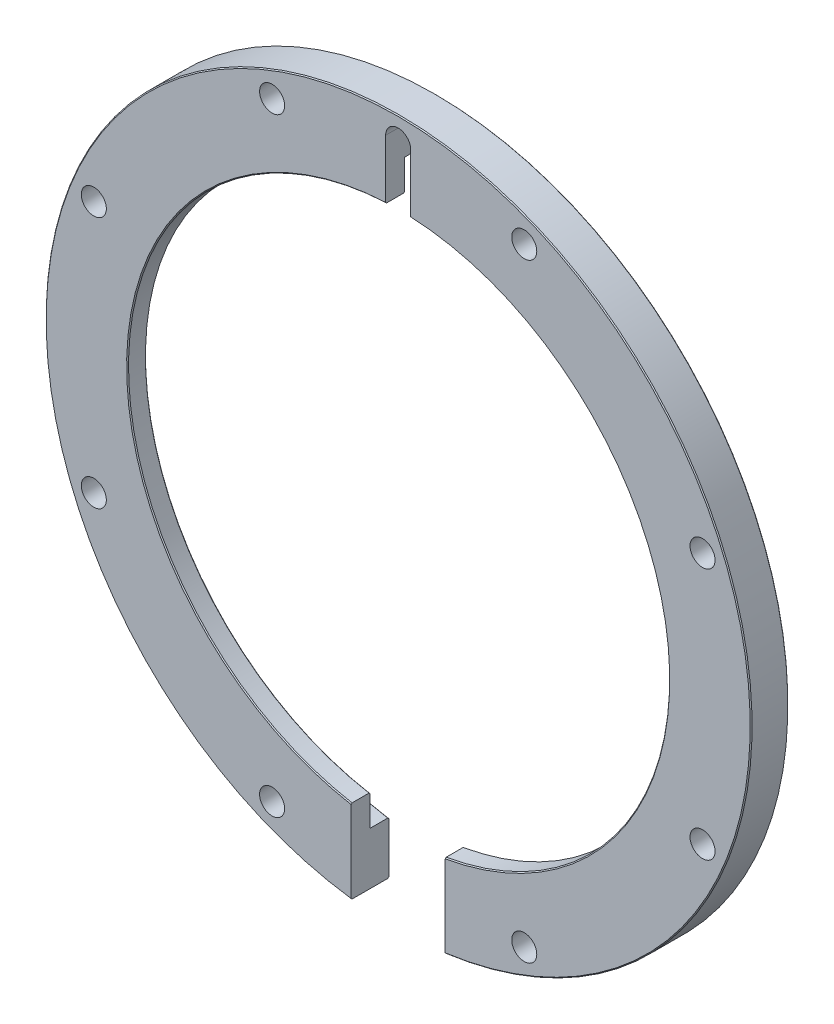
ISO-10303-21;
HEADER;
FILE_DESCRIPTION(('STEP AP214'),'2;1');
FILE_NAME('part.step','',(''),(''),'','','');
FILE_SCHEMA(('AUTOMOTIVE_DESIGN { 1 0 10303 214 1 1 1 1 }'));
ENDSEC;
DATA;
#1=APPLICATION_CONTEXT('core data for automotive mechanical design processes');
#2=APPLICATION_PROTOCOL_DEFINITION('international standard','automotive_design',2000,#1);
#3=PRODUCT_CONTEXT('',#1,'mechanical');
#4=PRODUCT('Part','Part','',(#3));
#5=PRODUCT_RELATED_PRODUCT_CATEGORY('part','',(#4));
#6=PRODUCT_DEFINITION_FORMATION('','',#4);
#7=PRODUCT_DEFINITION_CONTEXT('part definition',#1,'design');
#8=PRODUCT_DEFINITION('design','',#6,#7);
#9=PRODUCT_DEFINITION_SHAPE('','',#8);
#10=(LENGTH_UNIT() NAMED_UNIT(*) SI_UNIT(.MILLI.,.METRE.));
#11=(NAMED_UNIT(*) PLANE_ANGLE_UNIT() SI_UNIT($,.RADIAN.));
#12=(NAMED_UNIT(*) SI_UNIT($,.STERADIAN.) SOLID_ANGLE_UNIT());
#13=UNCERTAINTY_MEASURE_WITH_UNIT(LENGTH_MEASURE(1.E-05),#10,'distance_accuracy_value','');
#14=(GEOMETRIC_REPRESENTATION_CONTEXT(3) GLOBAL_UNCERTAINTY_ASSIGNED_CONTEXT((#13)) GLOBAL_UNIT_ASSIGNED_CONTEXT((#10,
#11,#12)) REPRESENTATION_CONTEXT('',''));
#15=CARTESIAN_POINT('',(0.,0.,0.));
#16=DIRECTION('',(0.,0.,1.));
#17=DIRECTION('',(1.,0.,0.));
#18=AXIS2_PLACEMENT_3D('',#15,#16,#17);
#19=CARTESIAN_POINT('',(-101.6,-107.95,5.08));
#20=DIRECTION('',(0.,0.,-1.));
#21=DIRECTION('',(-1.,0.,0.));
#22=AXIS2_PLACEMENT_3D('',#19,#20,#21);
#23=CYLINDRICAL_SURFACE('',#22,81.2799999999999);
#24=DIRECTION('',(0.,0.,-1.));
#25=VECTOR('',#24,1.);
#26=CARTESIAN_POINT('',(-104.9782,-26.7402335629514,5.08));
#27=LINE('',#26,#25);
#28=CARTESIAN_POINT('',(-104.9782,-26.7402335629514,5.08));
#29=VERTEX_POINT('',#28);
#30=CARTESIAN_POINT('',(-104.9782,-26.7402335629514,0.254000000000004));
#31=VERTEX_POINT('',#30);
#32=EDGE_CURVE('E859',#29,#31,#27,.T.);
#33=ORIENTED_EDGE('',*,*,#32,.F.);
#34=CARTESIAN_POINT('',(-101.6,-107.95,5.08));
#35=DIRECTION('',(0.,0.,1.));
#36=DIRECTION('',(1.,0.,0.));
#37=AXIS2_PLACEMENT_3D('',#34,#35,#36);
#38=CIRCLE('',#37,81.2799999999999);
#39=CARTESIAN_POINT('',(-114.3,-188.231681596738,5.08));
#40=VERTEX_POINT('',#39);
#41=EDGE_CURVE('E444',#29,#40,#38,.T.);
#42=ORIENTED_EDGE('',*,*,#41,.T.);
#43=DIRECTION('',(0.,0.,-1.));
#44=VECTOR('',#43,1.);
#45=CARTESIAN_POINT('',(-114.3,-188.231681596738,5.08));
#46=LINE('',#45,#44);
#47=CARTESIAN_POINT('',(-114.3,-188.231681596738,0.254000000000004));
#48=VERTEX_POINT('',#47);
#49=EDGE_CURVE('E523',#48,#40,#46,.F.);
#50=ORIENTED_EDGE('',*,*,#49,.F.);
#51=CARTESIAN_POINT('',(-101.6,-107.95,0.254000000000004));
#52=DIRECTION('',(0.,0.,1.));
#53=DIRECTION('',(1.,0.,0.));
#54=AXIS2_PLACEMENT_3D('',#51,#52,#53);
#55=CIRCLE('',#54,81.2799999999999);
#56=EDGE_CURVE('E594',#48,#31,#55,.F.);
#57=ORIENTED_EDGE('',*,*,#56,.T.);
#58=EDGE_LOOP('',(#33,#42,#50,#57));
#59=FACE_BOUND('',#58,.T.);
#60=ADVANCED_FACE('F47',(#59),#23,.F.);
#61=CARTESIAN_POINT('',(-101.6,-107.95,5.08));
#62=DIRECTION('',(0.,0.,1.));
#63=DIRECTION('',(1.,0.,0.));
#64=AXIS2_PLACEMENT_3D('',#61,#62,#63);
#65=PLANE('',#64);
#66=ORIENTED_EDGE('',*,*,#41,.F.);
#67=DIRECTION('',(0.,-1.,0.));
#68=VECTOR('',#67,1.);
#69=CARTESIAN_POINT('',(-104.9782,-107.95,5.08));
#70=LINE('',#69,#68);
#71=CARTESIAN_POINT('',(-104.9782,-34.7489098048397,5.08));
#72=VERTEX_POINT('',#71);
#73=EDGE_CURVE('E550',#29,#72,#70,.T.);
#74=ORIENTED_EDGE('',*,*,#73,.T.);
#75=CARTESIAN_POINT('',(-101.6,-107.95,5.08));
#76=DIRECTION('',(0.,0.,1.));
#77=DIRECTION('',(1.,0.,0.));
#78=AXIS2_PLACEMENT_3D('',#75,#76,#77);
#79=CIRCLE('',#78,73.279);
#80=CARTESIAN_POINT('',(-114.3,-180.120089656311,5.08));
#81=VERTEX_POINT('',#80);
#82=EDGE_CURVE('E419',#72,#81,#79,.T.);
#83=ORIENTED_EDGE('',*,*,#82,.T.);
#84=DIRECTION('',(0.,-1.,0.));
#85=VECTOR('',#84,1.);
#86=CARTESIAN_POINT('',(-114.3,-107.95,5.08));
#87=LINE('',#86,#85);
#88=EDGE_CURVE('E526',#81,#40,#87,.T.);
#89=ORIENTED_EDGE('',*,*,#88,.T.);
#90=EDGE_LOOP('',(#66,#74,#83,#89));
#91=FACE_BOUND('',#90,.T.);
#92=ADVANCED_FACE('F563',(#91),#65,.F.);
#93=CARTESIAN_POINT('',(-101.6,-107.95,10.16));
#94=DIRECTION('',(0.,0.,-1.));
#95=DIRECTION('',(-1.,0.,0.));
#96=AXIS2_PLACEMENT_3D('',#93,#94,#95);
#97=CYLINDRICAL_SURFACE('',#96,73.025);
#98=DIRECTION('',(0.,0.,1.));
#99=VECTOR('',#98,1.);
#100=CARTESIAN_POINT('',(-104.9782,-35.0031810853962,0.));
#101=LINE('',#100,#99);
#102=CARTESIAN_POINT('',(-104.9782,-35.0031810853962,5.33400000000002));
#103=VERTEX_POINT('',#102);
#104=CARTESIAN_POINT('',(-104.9782,-35.0031810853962,9.90600000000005));
#105=VERTEX_POINT('',#104);
#106=EDGE_CURVE('E232',#103,#105,#101,.T.);
#107=ORIENTED_EDGE('',*,*,#106,.T.);
#108=CARTESIAN_POINT('',(-101.6,-107.95,9.90600000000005));
#109=DIRECTION('',(0.,0.,1.));
#110=DIRECTION('',(1.,0.,0.));
#111=AXIS2_PLACEMENT_3D('',#108,#109,#110);
#112=CIRCLE('',#111,73.025);
#113=CARTESIAN_POINT('',(-114.3,-179.862172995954,9.90600000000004));
#114=VERTEX_POINT('',#113);
#115=EDGE_CURVE('E383',#105,#114,#112,.T.);
#116=ORIENTED_EDGE('',*,*,#115,.T.);
#117=DIRECTION('',(0.,0.,-1.));
#118=VECTOR('',#117,1.);
#119=CARTESIAN_POINT('',(-114.3,-179.862172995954,10.16));
#120=LINE('',#119,#118);
#121=CARTESIAN_POINT('',(-114.3,-179.862172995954,5.33400000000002));
#122=VERTEX_POINT('',#121);
#123=EDGE_CURVE('E420',#122,#114,#120,.F.);
#124=ORIENTED_EDGE('',*,*,#123,.F.);
#125=CARTESIAN_POINT('',(-101.6,-107.95,5.33400000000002));
#126=DIRECTION('',(0.,0.,1.));
#127=DIRECTION('',(1.,0.,0.));
#128=AXIS2_PLACEMENT_3D('',#125,#126,#127);
#129=CIRCLE('',#128,73.025);
#130=EDGE_CURVE('E398',#122,#103,#129,.F.);
#131=ORIENTED_EDGE('',*,*,#130,.T.);
#132=EDGE_LOOP('',(#107,#116,#124,#131));
#133=FACE_BOUND('',#132,.T.);
#134=ADVANCED_FACE('F570',(#133),#97,.F.);
#135=CARTESIAN_POINT('',(-101.6,-107.95,5.08));
#136=DIRECTION('',(0.,0.,-1.));
#137=DIRECTION('',(-1.,0.,0.));
#138=AXIS2_PLACEMENT_3D('',#135,#136,#137);
#139=CONICAL_SURFACE('',#138,73.279,0.785398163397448);
#140=CARTESIAN_POINT('',(-104.9782,-35.4061024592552,5.73648761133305));
#141=CARTESIAN_POINT('',(-104.9782,-35.2192610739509,5.54984846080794));
#142=CARTESIAN_POINT('',(-104.9782,-35.032420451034,5.36320854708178));
#143=CARTESIAN_POINT('',(-104.9782,-34.658740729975,4.98992719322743));
#144=CARTESIAN_POINT('',(-104.9782,-34.471901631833,4.80328575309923));
#145=CARTESIAN_POINT('',(-104.9782,-34.2850632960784,4.61664354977));
#146=B_SPLINE_CURVE_WITH_KNOTS('',3,(#140,#141,#142,#143,#144,#145),.UNSPECIFIED.,.F.,.F.,(4,2,
4),(0.,0.792271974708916,1.58454394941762),.UNSPECIFIED.);
#147=EDGE_CURVE('E539',#103,#72,#146,.T.);
#148=ORIENTED_EDGE('',*,*,#147,.F.);
#149=ORIENTED_EDGE('',*,*,#130,.F.);
#150=CARTESIAN_POINT('',(-114.3,-180.120089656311,5.08));
#151=CARTESIAN_POINT('',(-114.3,-180.077104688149,5.12233449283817));
#152=CARTESIAN_POINT('',(-114.3,-180.034119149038,5.16466840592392));
#153=CARTESIAN_POINT('',(-114.3,-179.948146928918,5.24933507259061));
#154=CARTESIAN_POINT('',(-114.3,-179.90516024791,5.29166782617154));
#155=CARTESIAN_POINT('',(-114.3,-179.862172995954,5.33400000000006));
#156=B_SPLINE_CURVE_WITH_KNOTS('',3,(#150,#151,#152,#153,#154,#155),.UNSPECIFIED.,.F.,.F.,(4,2,
4),(0.,0.180995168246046,0.361990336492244),.UNSPECIFIED.);
#157=EDGE_CURVE('E296',#81,#122,#156,.T.);
#158=ORIENTED_EDGE('',*,*,#157,.F.);
#159=ORIENTED_EDGE('',*,*,#82,.F.);
#160=EDGE_LOOP('',(#148,#149,#158,#159));
#161=FACE_BOUND('',#160,.T.);
#162=ADVANCED_FACE('F290',(#161),#139,.F.);
#163=CARTESIAN_POINT('',(-101.6,-107.95,0.));
#164=DIRECTION('',(0.,0.,-1.));
#165=DIRECTION('',(-1.,0.,0.));
#166=AXIS2_PLACEMENT_3D('',#163,#164,#165);
#167=CONICAL_SURFACE('',#166,81.534,0.785398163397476);
#168=CARTESIAN_POINT('',(-104.9782,-38.0022033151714,11.5046740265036));
#169=CARTESIAN_POINT('',(-104.9782,-36.1769678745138,9.68156060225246));
#170=CARTESIAN_POINT('',(-104.9782,-34.3518124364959,7.85836708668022));
#171=CARTESIAN_POINT('',(-104.9782,-30.7016347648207,4.21184673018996));
#172=CARTESIAN_POINT('',(-104.9782,-28.876612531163,2.38851988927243));
#173=CARTESIAN_POINT('',(-104.9782,-25.2266744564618,-1.25824027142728));
#174=CARTESIAN_POINT('',(-104.9782,-23.4017586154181,-3.08167359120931));
#175=CARTESIAN_POINT('',(-104.9782,-19.752015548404,-6.72862892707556));
#176=CARTESIAN_POINT('',(-104.9782,-17.9271883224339,-8.5521509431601));
#177=CARTESIAN_POINT('',(-104.9782,-16.102396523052,-10.3757084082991));
#178=B_SPLINE_CURVE_WITH_KNOTS('',3,(#168,#169,#170,#171,#172,#173,#174,#175,#176,#177),
.UNSPECIFIED.,.F.,.F.,(4,2,2,2,4),(0.,7.73931796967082,15.4786359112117,23.2179538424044,
30.9572718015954),.UNSPECIFIED.);
#179=CARTESIAN_POINT('',(-104.9782,-26.4860145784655,0.));
#180=VERTEX_POINT('',#179);
#181=EDGE_CURVE('E277',#31,#180,#178,.T.);
#182=ORIENTED_EDGE('',*,*,#181,.F.);
#183=ORIENTED_EDGE('',*,*,#56,.F.);
#184=CARTESIAN_POINT('',(-114.3,-188.488830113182,0.));
#185=CARTESIAN_POINT('',(-114.3,-188.445972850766,0.0423341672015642));
#186=CARTESIAN_POINT('',(-114.3,-188.403115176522,0.0846679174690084));
#187=CARTESIAN_POINT('',(-114.3,-188.317399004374,0.169334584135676));
#188=CARTESIAN_POINT('',(-114.3,-188.27454050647,0.2116675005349));
#189=CARTESIAN_POINT('',(-114.3,-188.231681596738,0.254000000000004));
#190=B_SPLINE_CURVE_WITH_KNOTS('',3,(#184,#185,#186,#187,#188,#189),.UNSPECIFIED.,.F.,.F.,(4,2,
4),(0.,0.180721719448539,0.361443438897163),.UNSPECIFIED.);
#191=CARTESIAN_POINT('',(-114.3,-188.488830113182,0.));
#192=VERTEX_POINT('',#191);
#193=EDGE_CURVE('E364',#192,#48,#190,.T.);
#194=ORIENTED_EDGE('',*,*,#193,.F.);
#195=CARTESIAN_POINT('',(-101.6,-107.95,0.));
#196=DIRECTION('',(0.,0.,1.));
#197=DIRECTION('',(1.,0.,0.));
#198=AXIS2_PLACEMENT_3D('',#195,#196,#197);
#199=CIRCLE('',#198,81.5339999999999);
#200=EDGE_CURVE('E601',#180,#192,#199,.T.);
#201=ORIENTED_EDGE('',*,*,#200,.F.);
#202=EDGE_LOOP('',(#182,#183,#194,#201));
#203=FACE_BOUND('',#202,.T.);
#204=ADVANCED_FACE('F646',(#203),#167,.F.);
#205=CARTESIAN_POINT('',(-101.6,-107.95,9.90600000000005));
#206=DIRECTION('',(0.,0.,1.));
#207=DIRECTION('',(1.,0.,0.));
#208=AXIS2_PLACEMENT_3D('',#205,#206,#207);
#209=CONICAL_SURFACE('',#208,73.025,0.785398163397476);
#210=CARTESIAN_POINT('',(-104.9782,-34.3901294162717,10.5184007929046));
#211=CARTESIAN_POINT('',(-104.9782,-34.5769680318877,10.3317588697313));
#212=CARTESIAN_POINT('',(-104.9782,-34.7638074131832,10.1451177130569));
#213=CARTESIAN_POINT('',(-104.9782,-35.1374877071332,9.77183693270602));
#214=CARTESIAN_POINT('',(-104.9782,-35.3243286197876,9.58519730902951));
#215=CARTESIAN_POINT('',(-104.9782,-35.5111702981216,9.39855845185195));
#216=B_SPLINE_CURVE_WITH_KNOTS('',3,(#210,#211,#212,#213,#214,#215),.UNSPECIFIED.,.F.,.F.,(4,2,
4),(0.,0.79227197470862,1.58454394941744),.UNSPECIFIED.);
#217=CARTESIAN_POINT('',(-104.9782,-34.7489098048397,10.16));
#218=VERTEX_POINT('',#217);
#219=EDGE_CURVE('E11',#218,#105,#216,.T.);
#220=ORIENTED_EDGE('',*,*,#219,.F.);
#221=CARTESIAN_POINT('',(-101.6,-107.95,10.16));
#222=DIRECTION('',(0.,0.,1.));
#223=DIRECTION('',(1.,0.,0.));
#224=AXIS2_PLACEMENT_3D('',#221,#222,#223);
#225=CIRCLE('',#224,73.279);
#226=CARTESIAN_POINT('',(-114.3,-180.120089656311,10.16));
#227=VERTEX_POINT('',#226);
#228=EDGE_CURVE('E613',#227,#218,#225,.F.);
#229=ORIENTED_EDGE('',*,*,#228,.F.);
#230=CARTESIAN_POINT('',(-114.3,-179.862172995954,9.90600000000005));
#231=CARTESIAN_POINT('',(-114.3,-179.90516024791,9.94833217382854));
#232=CARTESIAN_POINT('',(-114.3,-179.948146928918,9.99066492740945));
#233=CARTESIAN_POINT('',(-114.3,-180.034119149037,10.0753315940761));
#234=CARTESIAN_POINT('',(-114.3,-180.077104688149,10.1176655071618));
#235=CARTESIAN_POINT('',(-114.3,-180.120089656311,10.16));
#236=B_SPLINE_CURVE_WITH_KNOTS('',3,(#230,#231,#232,#233,#234,#235),.UNSPECIFIED.,.F.,.F.,(4,2,
4),(0.,0.180995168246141,0.361990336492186),.UNSPECIFIED.);
#237=EDGE_CURVE('E365',#114,#227,#236,.T.);
#238=ORIENTED_EDGE('',*,*,#237,.F.);
#239=ORIENTED_EDGE('',*,*,#115,.F.);
#240=EDGE_LOOP('',(#220,#229,#238,#239));
#241=FACE_BOUND('',#240,.T.);
#242=ADVANCED_FACE('F656',(#241),#209,.F.);
#243=CARTESIAN_POINT('',(-101.6,-107.95,0.));
#244=DIRECTION('',(0.,0.,1.));
#245=DIRECTION('',(1.,0.,0.));
#246=AXIS2_PLACEMENT_3D('',#243,#244,#245);
#247=PLANE('',#246);
#248=CARTESIAN_POINT('',(-183.732890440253,-141.970557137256,0.));
#249=DIRECTION('',(0.,0.,1.));
#250=DIRECTION('',(1.,0.,0.));
#251=AXIS2_PLACEMENT_3D('',#248,#249,#250);
#252=CIRCLE('',#251,3.37819999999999);
#253=CARTESIAN_POINT('',(-180.354690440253,-141.970557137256,0.));
#254=VERTEX_POINT('',#253);
#255=EDGE_CURVE('E498',#254,#254,#252,.T.);
#256=ORIENTED_EDGE('',*,*,#255,.T.);
#257=EDGE_LOOP('',(#256));
#258=FACE_BOUND('',#257,.T.);
#259=CARTESIAN_POINT('',(-135.620557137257,-190.082890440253,0.));
#260=DIRECTION('',(0.,0.,1.));
#261=DIRECTION('',(1.,0.,0.));
#262=AXIS2_PLACEMENT_3D('',#259,#260,#261);
#263=CIRCLE('',#262,3.37819999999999);
#264=CARTESIAN_POINT('',(-132.242357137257,-190.082890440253,0.));
#265=VERTEX_POINT('',#264);
#266=EDGE_CURVE('E490',#265,#265,#263,.T.);
#267=ORIENTED_EDGE('',*,*,#266,.T.);
#268=EDGE_LOOP('',(#267));
#269=FACE_BOUND('',#268,.T.);
#270=CARTESIAN_POINT('',(-183.732890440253,-73.9294428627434,0.));
#271=DIRECTION('',(0.,0.,1.));
#272=DIRECTION('',(1.,0.,0.));
#273=AXIS2_PLACEMENT_3D('',#270,#271,#272);
#274=CIRCLE('',#273,3.37819999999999);
#275=CARTESIAN_POINT('',(-180.354690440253,-73.9294428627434,0.));
#276=VERTEX_POINT('',#275);
#277=EDGE_CURVE('E482',#276,#276,#274,.T.);
#278=ORIENTED_EDGE('',*,*,#277,.T.);
#279=EDGE_LOOP('',(#278));
#280=FACE_BOUND('',#279,.T.);
#281=CARTESIAN_POINT('',(-135.620557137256,-25.8171095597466,0.));
#282=DIRECTION('',(0.,0.,1.));
#283=DIRECTION('',(1.,0.,0.));
#284=AXIS2_PLACEMENT_3D('',#281,#282,#283);
#285=CIRCLE('',#284,3.37819999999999);
#286=CARTESIAN_POINT('',(-132.242357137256,-25.8171095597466,0.));
#287=VERTEX_POINT('',#286);
#288=EDGE_CURVE('E474',#287,#287,#285,.T.);
#289=ORIENTED_EDGE('',*,*,#288,.T.);
#290=EDGE_LOOP('',(#289));
#291=FACE_BOUND('',#290,.T.);
#292=CARTESIAN_POINT('',(-67.5794428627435,-25.8171095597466,0.));
#293=DIRECTION('',(0.,0.,1.));
#294=DIRECTION('',(1.,0.,0.));
#295=AXIS2_PLACEMENT_3D('',#292,#293,#294);
#296=CIRCLE('',#295,3.37819999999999);
#297=CARTESIAN_POINT('',(-64.2012428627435,-25.8171095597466,0.));
#298=VERTEX_POINT('',#297);
#299=EDGE_CURVE('E466',#298,#298,#296,.T.);
#300=ORIENTED_EDGE('',*,*,#299,.T.);
#301=EDGE_LOOP('',(#300));
#302=FACE_BOUND('',#301,.T.);
#303=CARTESIAN_POINT('',(-19.4671095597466,-73.9294428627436,0.));
#304=DIRECTION('',(0.,0.,1.));
#305=DIRECTION('',(1.,0.,0.));
#306=AXIS2_PLACEMENT_3D('',#303,#304,#305);
#307=CIRCLE('',#306,3.37820000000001);
#308=CARTESIAN_POINT('',(-16.0889095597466,-73.9294428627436,0.));
#309=VERTEX_POINT('',#308);
#310=EDGE_CURVE('E458',#309,#309,#307,.T.);
#311=ORIENTED_EDGE('',*,*,#310,.T.);
#312=EDGE_LOOP('',(#311));
#313=FACE_BOUND('',#312,.T.);
#314=CARTESIAN_POINT('',(-19.4671095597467,-141.970557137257,0.));
#315=DIRECTION('',(0.,0.,1.));
#316=DIRECTION('',(1.,0.,0.));
#317=AXIS2_PLACEMENT_3D('',#314,#315,#316);
#318=CIRCLE('',#317,3.37819999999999);
#319=CARTESIAN_POINT('',(-16.0889095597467,-141.970557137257,0.));
#320=VERTEX_POINT('',#319);
#321=EDGE_CURVE('E450',#320,#320,#318,.T.);
#322=ORIENTED_EDGE('',*,*,#321,.T.);
#323=EDGE_LOOP('',(#322));
#324=FACE_BOUND('',#323,.T.);
#325=CARTESIAN_POINT('',(-67.5794428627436,-190.082890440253,0.));
#326=DIRECTION('',(0.,0.,1.));
#327=DIRECTION('',(1.,0.,0.));
#328=AXIS2_PLACEMENT_3D('',#325,#326,#327);
#329=CIRCLE('',#328,3.37819999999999);
#330=CARTESIAN_POINT('',(-64.2012428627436,-190.082890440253,0.));
#331=VERTEX_POINT('',#330);
#332=EDGE_CURVE('E449',#331,#331,#329,.T.);
#333=ORIENTED_EDGE('',*,*,#332,.T.);
#334=EDGE_LOOP('',(#333));
#335=FACE_BOUND('',#334,.T.);
#336=CARTESIAN_POINT('',(-101.6,-19.05,0.));
#337=DIRECTION('',(0.,0.,1.));
#338=DIRECTION('',(1.,0.,0.));
#339=AXIS2_PLACEMENT_3D('',#336,#337,#338);
#340=CIRCLE('',#339,3.3782);
#341=CARTESIAN_POINT('',(-98.2218000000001,-19.05,0.));
#342=VERTEX_POINT('',#341);
#343=CARTESIAN_POINT('',(-104.9782,-19.05,0.));
#344=VERTEX_POINT('',#343);
#345=EDGE_CURVE('E205',#342,#344,#340,.T.);
#346=ORIENTED_EDGE('',*,*,#345,.T.);
#347=DIRECTION('',(0.,-1.,0.));
#348=VECTOR('',#347,1.);
#349=CARTESIAN_POINT('',(-104.9782,-19.05,0.));
#350=LINE('',#349,#348);
#351=EDGE_CURVE('E211',#344,#180,#350,.T.);
#352=ORIENTED_EDGE('',*,*,#351,.T.);
#353=ORIENTED_EDGE('',*,*,#200,.T.);
#354=DIRECTION('',(0.,-1.,0.));
#355=VECTOR('',#354,1.);
#356=CARTESIAN_POINT('',(-114.3,-210.154852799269,0.));
#357=LINE('',#356,#355);
#358=CARTESIAN_POINT('',(-114.3,-202.093242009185,0.));
#359=VERTEX_POINT('',#358);
#360=EDGE_CURVE('E530',#192,#359,#357,.T.);
#361=ORIENTED_EDGE('',*,*,#360,.T.);
#362=CARTESIAN_POINT('',(-101.6,-107.95,0.));
#363=DIRECTION('',(0.,0.,1.));
#364=DIRECTION('',(1.,0.,0.));
#365=AXIS2_PLACEMENT_3D('',#362,#363,#364);
#366=CIRCLE('',#365,94.996);
#367=CARTESIAN_POINT('',(-88.9,-202.093242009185,0.));
#368=VERTEX_POINT('',#367);
#369=EDGE_CURVE('E314',#359,#368,#366,.F.);
#370=ORIENTED_EDGE('',*,*,#369,.T.);
#371=DIRECTION('',(0.,1.,0.));
#372=VECTOR('',#371,1.);
#373=CARTESIAN_POINT('',(-88.9,-210.154852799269,0.));
#374=LINE('',#373,#372);
#375=CARTESIAN_POINT('',(-88.9,-188.488830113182,0.));
#376=VERTEX_POINT('',#375);
#377=EDGE_CURVE('E535',#368,#376,#374,.T.);
#378=ORIENTED_EDGE('',*,*,#377,.T.);
#379=CARTESIAN_POINT('',(-98.2218000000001,-26.4860145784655,0.));
#380=VERTEX_POINT('',#379);
#381=EDGE_CURVE('E217',#376,#380,#199,.T.);
#382=ORIENTED_EDGE('',*,*,#381,.T.);
#383=DIRECTION('',(0.,1.,0.));
#384=VECTOR('',#383,1.);
#385=CARTESIAN_POINT('',(-98.2218000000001,-19.05,0.));
#386=LINE('',#385,#384);
#387=EDGE_CURVE('E194',#380,#342,#386,.T.);
#388=ORIENTED_EDGE('',*,*,#387,.T.);
#389=EDGE_LOOP('',(#346,#352,#353,#361,#370,#378,#382,#388));
#390=FACE_BOUND('',#389,.T.);
#391=ADVANCED_FACE('F214',(#258,#269,#280,#291,#302,#313,#324,#335,#390),#247,.F.);
#392=CARTESIAN_POINT('',(-101.6,-107.95,5.08));
#393=DIRECTION('',(0.,0.,-1.));
#394=DIRECTION('',(-1.,0.,0.));
#395=AXIS2_PLACEMENT_3D('',#392,#393,#394);
#396=CYLINDRICAL_SURFACE('',#395,95.25);
#397=DIRECTION('',(0.,0.,-1.));
#398=VECTOR('',#397,1.);
#399=CARTESIAN_POINT('',(-88.9,-202.349536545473,5.08));
#400=LINE('',#399,#398);
#401=CARTESIAN_POINT('',(-88.9,-202.349536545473,9.90599999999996));
#402=VERTEX_POINT('',#401);
#403=CARTESIAN_POINT('',(-88.9,-202.349536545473,0.253999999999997));
#404=VERTEX_POINT('',#403);
#405=EDGE_CURVE('E506',#402,#404,#400,.T.);
#406=ORIENTED_EDGE('',*,*,#405,.T.);
#407=CARTESIAN_POINT('',(-101.6,-107.95,0.254000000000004));
#408=DIRECTION('',(0.,0.,1.));
#409=DIRECTION('',(1.,0.,0.));
#410=AXIS2_PLACEMENT_3D('',#407,#408,#409);
#411=CIRCLE('',#410,95.25);
#412=CARTESIAN_POINT('',(-114.3,-202.349536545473,0.254000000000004));
#413=VERTEX_POINT('',#412);
#414=EDGE_CURVE('E605',#404,#413,#411,.T.);
#415=ORIENTED_EDGE('',*,*,#414,.T.);
#416=DIRECTION('',(0.,0.,-1.));
#417=VECTOR('',#416,1.);
#418=CARTESIAN_POINT('',(-114.3,-202.349536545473,5.08));
#419=LINE('',#418,#417);
#420=CARTESIAN_POINT('',(-114.3,-202.349536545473,9.90599999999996));
#421=VERTEX_POINT('',#420);
#422=EDGE_CURVE('E519',#413,#421,#419,.F.);
#423=ORIENTED_EDGE('',*,*,#422,.T.);
#424=CARTESIAN_POINT('',(-101.6,-107.95,9.90599999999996));
#425=DIRECTION('',(0.,0.,1.));
#426=DIRECTION('',(1.,0.,0.));
#427=AXIS2_PLACEMENT_3D('',#424,#425,#426);
#428=CIRCLE('',#427,95.25);
#429=EDGE_CURVE('E600',#421,#402,#428,.F.);
#430=ORIENTED_EDGE('',*,*,#429,.T.);
#431=EDGE_LOOP('',(#406,#415,#423,#430));
#432=FACE_BOUND('',#431,.T.);
#433=ADVANCED_FACE('F291',(#432),#396,.T.);
#434=DIRECTION('',(0.,0.,-1.));
#435=VECTOR('',#434,1.);
#436=CARTESIAN_POINT('',(-98.2218000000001,-26.7402335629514,5.08));
#437=LINE('',#436,#435);
#438=CARTESIAN_POINT('',(-98.2218000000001,-26.7402335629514,0.254000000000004));
#439=VERTEX_POINT('',#438);
#440=CARTESIAN_POINT('',(-98.2218000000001,-26.7402335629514,5.08));
#441=VERTEX_POINT('',#440);
#442=EDGE_CURVE('E249',#439,#441,#437,.F.);
#443=ORIENTED_EDGE('',*,*,#442,.F.);
#444=CARTESIAN_POINT('',(-88.9,-188.231681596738,0.254000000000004));
#445=VERTEX_POINT('',#444);
#446=EDGE_CURVE('E588',#439,#445,#55,.F.);
#447=ORIENTED_EDGE('',*,*,#446,.T.);
#448=DIRECTION('',(0.,0.,-1.));
#449=VECTOR('',#448,1.);
#450=CARTESIAN_POINT('',(-88.9,-188.231681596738,5.08));
#451=LINE('',#450,#449);
#452=CARTESIAN_POINT('',(-88.9,-188.231681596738,5.08));
#453=VERTEX_POINT('',#452);
#454=EDGE_CURVE('E512',#453,#445,#451,.T.);
#455=ORIENTED_EDGE('',*,*,#454,.F.);
#456=EDGE_CURVE('E440',#453,#441,#38,.T.);
#457=ORIENTED_EDGE('',*,*,#456,.T.);
#458=EDGE_LOOP('',(#443,#447,#455,#457));
#459=FACE_BOUND('',#458,.T.);
#460=ADVANCED_FACE('F566',(#459),#23,.F.);
#461=CARTESIAN_POINT('',(-101.6,-107.95,10.16));
#462=DIRECTION('',(0.,0.,1.));
#463=DIRECTION('',(1.,0.,0.));
#464=AXIS2_PLACEMENT_3D('',#461,#462,#463);
#465=PLANE('',#464);
#466=DIRECTION('',(0.,-1.,0.));
#467=VECTOR('',#466,1.);
#468=CARTESIAN_POINT('',(-104.9782,-19.05,10.16));
#469=LINE('',#468,#467);
#470=CARTESIAN_POINT('',(-104.9782,-19.05,10.16));
#471=VERTEX_POINT('',#470);
#472=EDGE_CURVE('E219',#471,#218,#469,.T.);
#473=ORIENTED_EDGE('',*,*,#472,.F.);
#474=CARTESIAN_POINT('',(-101.6,-19.05,10.16));
#475=DIRECTION('',(0.,0.,1.));
#476=DIRECTION('',(1.,0.,0.));
#477=AXIS2_PLACEMENT_3D('',#474,#475,#476);
#478=CIRCLE('',#477,3.3782);
#479=CARTESIAN_POINT('',(-98.2218000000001,-19.05,10.16));
#480=VERTEX_POINT('',#479);
#481=EDGE_CURVE('E223',#480,#471,#478,.T.);
#482=ORIENTED_EDGE('',*,*,#481,.F.);
#483=DIRECTION('',(0.,1.,0.));
#484=VECTOR('',#483,1.);
#485=CARTESIAN_POINT('',(-98.2218000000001,-19.05,10.16));
#486=LINE('',#485,#484);
#487=CARTESIAN_POINT('',(-98.2218000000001,-34.7489098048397,10.16));
#488=VERTEX_POINT('',#487);
#489=EDGE_CURVE('E197',#488,#480,#486,.T.);
#490=ORIENTED_EDGE('',*,*,#489,.F.);
#491=CARTESIAN_POINT('',(-88.9,-180.120089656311,10.16));
#492=VERTEX_POINT('',#491);
#493=EDGE_CURVE('E612',#488,#492,#225,.F.);
#494=ORIENTED_EDGE('',*,*,#493,.T.);
#495=DIRECTION('',(0.,1.,0.));
#496=VECTOR('',#495,1.);
#497=CARTESIAN_POINT('',(-88.9,-210.154852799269,10.16));
#498=LINE('',#497,#496);
#499=CARTESIAN_POINT('',(-88.9,-202.093242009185,10.16));
#500=VERTEX_POINT('',#499);
#501=EDGE_CURVE('E536',#500,#492,#498,.T.);
#502=ORIENTED_EDGE('',*,*,#501,.F.);
#503=CARTESIAN_POINT('',(-101.6,-107.95,10.16));
#504=DIRECTION('',(0.,0.,1.));
#505=DIRECTION('',(1.,0.,0.));
#506=AXIS2_PLACEMENT_3D('',#503,#504,#505);
#507=CIRCLE('',#506,94.996);
#508=CARTESIAN_POINT('',(-114.3,-202.093242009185,10.16));
#509=VERTEX_POINT('',#508);
#510=EDGE_CURVE('E609',#500,#509,#507,.T.);
#511=ORIENTED_EDGE('',*,*,#510,.T.);
#512=DIRECTION('',(0.,-1.,0.));
#513=VECTOR('',#512,1.);
#514=CARTESIAN_POINT('',(-114.3,-210.154852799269,10.16));
#515=LINE('',#514,#513);
#516=EDGE_CURVE('E531',#227,#509,#515,.T.);
#517=ORIENTED_EDGE('',*,*,#516,.F.);
#518=ORIENTED_EDGE('',*,*,#228,.T.);
#519=EDGE_LOOP('',(#473,#482,#490,#494,#502,#511,#517,#518));
#520=FACE_BOUND('',#519,.T.);
#521=CARTESIAN_POINT('',(-183.732890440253,-141.970557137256,10.16));
#522=DIRECTION('',(0.,0.,1.));
#523=DIRECTION('',(1.,0.,0.));
#524=AXIS2_PLACEMENT_3D('',#521,#522,#523);
#525=CIRCLE('',#524,3.37819999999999);
#526=CARTESIAN_POINT('',(-180.354690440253,-141.970557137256,10.16));
#527=VERTEX_POINT('',#526);
#528=EDGE_CURVE('E502',#527,#527,#525,.T.);
#529=ORIENTED_EDGE('',*,*,#528,.F.);
#530=EDGE_LOOP('',(#529));
#531=FACE_BOUND('',#530,.T.);
#532=CARTESIAN_POINT('',(-135.620557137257,-190.082890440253,10.16));
#533=DIRECTION('',(0.,0.,1.));
#534=DIRECTION('',(1.,0.,0.));
#535=AXIS2_PLACEMENT_3D('',#532,#533,#534);
#536=CIRCLE('',#535,3.37819999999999);
#537=CARTESIAN_POINT('',(-132.242357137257,-190.082890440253,10.16));
#538=VERTEX_POINT('',#537);
#539=EDGE_CURVE('E494',#538,#538,#536,.T.);
#540=ORIENTED_EDGE('',*,*,#539,.F.);
#541=EDGE_LOOP('',(#540));
#542=FACE_BOUND('',#541,.T.);
#543=CARTESIAN_POINT('',(-183.732890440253,-73.9294428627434,10.16));
#544=DIRECTION('',(0.,0.,1.));
#545=DIRECTION('',(1.,0.,0.));
#546=AXIS2_PLACEMENT_3D('',#543,#544,#545);
#547=CIRCLE('',#546,3.37819999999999);
#548=CARTESIAN_POINT('',(-180.354690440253,-73.9294428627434,10.16));
#549=VERTEX_POINT('',#548);
#550=EDGE_CURVE('E486',#549,#549,#547,.T.);
#551=ORIENTED_EDGE('',*,*,#550,.F.);
#552=EDGE_LOOP('',(#551));
#553=FACE_BOUND('',#552,.T.);
#554=CARTESIAN_POINT('',(-135.620557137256,-25.8171095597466,10.16));
#555=DIRECTION('',(0.,0.,1.));
#556=DIRECTION('',(1.,0.,0.));
#557=AXIS2_PLACEMENT_3D('',#554,#555,#556);
#558=CIRCLE('',#557,3.37819999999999);
#559=CARTESIAN_POINT('',(-132.242357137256,-25.8171095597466,10.16));
#560=VERTEX_POINT('',#559);
#561=EDGE_CURVE('E478',#560,#560,#558,.T.);
#562=ORIENTED_EDGE('',*,*,#561,.F.);
#563=EDGE_LOOP('',(#562));
#564=FACE_BOUND('',#563,.T.);
#565=CARTESIAN_POINT('',(-67.5794428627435,-25.8171095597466,10.16));
#566=DIRECTION('',(0.,0.,1.));
#567=DIRECTION('',(1.,0.,0.));
#568=AXIS2_PLACEMENT_3D('',#565,#566,#567);
#569=CIRCLE('',#568,3.37819999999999);
#570=CARTESIAN_POINT('',(-64.2012428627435,-25.8171095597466,10.16));
#571=VERTEX_POINT('',#570);
#572=EDGE_CURVE('E470',#571,#571,#569,.T.);
#573=ORIENTED_EDGE('',*,*,#572,.F.);
#574=EDGE_LOOP('',(#573));
#575=FACE_BOUND('',#574,.T.);
#576=CARTESIAN_POINT('',(-19.4671095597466,-73.9294428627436,10.16));
#577=DIRECTION('',(0.,0.,1.));
#578=DIRECTION('',(1.,0.,0.));
#579=AXIS2_PLACEMENT_3D('',#576,#577,#578);
#580=CIRCLE('',#579,3.37820000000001);
#581=CARTESIAN_POINT('',(-16.0889095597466,-73.9294428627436,10.16));
#582=VERTEX_POINT('',#581);
#583=EDGE_CURVE('E462',#582,#582,#580,.T.);
#584=ORIENTED_EDGE('',*,*,#583,.F.);
#585=EDGE_LOOP('',(#584));
#586=FACE_BOUND('',#585,.T.);
#587=CARTESIAN_POINT('',(-19.4671095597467,-141.970557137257,10.16));
#588=DIRECTION('',(0.,0.,1.));
#589=DIRECTION('',(1.,0.,0.));
#590=AXIS2_PLACEMENT_3D('',#587,#588,#589);
#591=CIRCLE('',#590,3.37819999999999);
#592=CARTESIAN_POINT('',(-16.0889095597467,-141.970557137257,10.16));
#593=VERTEX_POINT('',#592);
#594=EDGE_CURVE('E454',#593,#593,#591,.T.);
#595=ORIENTED_EDGE('',*,*,#594,.F.);
#596=EDGE_LOOP('',(#595));
#597=FACE_BOUND('',#596,.T.);
#598=CARTESIAN_POINT('',(-67.5794428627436,-190.082890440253,10.16));
#599=DIRECTION('',(0.,0.,1.));
#600=DIRECTION('',(1.,0.,0.));
#601=AXIS2_PLACEMENT_3D('',#598,#599,#600);
#602=CIRCLE('',#601,3.37819999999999);
#603=CARTESIAN_POINT('',(-64.2012428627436,-190.082890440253,10.16));
#604=VERTEX_POINT('',#603);
#605=EDGE_CURVE('E445',#604,#604,#602,.T.);
#606=ORIENTED_EDGE('',*,*,#605,.F.);
#607=EDGE_LOOP('',(#606));
#608=FACE_BOUND('',#607,.T.);
#609=ADVANCED_FACE('F576',(#520,#531,#542,#553,#564,#575,#586,#597,#608),#465,.T.);
#610=CARTESIAN_POINT('',(-88.9,-180.120089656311,5.08));
#611=VERTEX_POINT('',#610);
#612=CARTESIAN_POINT('',(-98.2218000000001,-34.7489098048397,5.08));
#613=VERTEX_POINT('',#612);
#614=EDGE_CURVE('E424',#611,#613,#79,.T.);
#615=ORIENTED_EDGE('',*,*,#614,.T.);
#616=DIRECTION('',(0.,1.,0.));
#617=VECTOR('',#616,1.);
#618=CARTESIAN_POINT('',(-98.2218000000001,-107.95,5.08));
#619=LINE('',#618,#617);
#620=EDGE_CURVE('E278',#613,#441,#619,.T.);
#621=ORIENTED_EDGE('',*,*,#620,.T.);
#622=ORIENTED_EDGE('',*,*,#456,.F.);
#623=DIRECTION('',(0.,1.,0.));
#624=VECTOR('',#623,1.);
#625=CARTESIAN_POINT('',(-88.9,-107.95,5.08));
#626=LINE('',#625,#624);
#627=EDGE_CURVE('E516',#453,#611,#626,.T.);
#628=ORIENTED_EDGE('',*,*,#627,.T.);
#629=EDGE_LOOP('',(#615,#621,#622,#628));
#630=FACE_BOUND('',#629,.T.);
#631=ADVANCED_FACE('F573',(#630),#65,.F.);
#632=DIRECTION('',(0.,0.,1.));
#633=VECTOR('',#632,1.);
#634=CARTESIAN_POINT('',(-98.2218000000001,-35.0031810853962,0.));
#635=LINE('',#634,#633);
#636=CARTESIAN_POINT('',(-98.2218000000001,-35.0031810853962,5.33400000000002));
#637=VERTEX_POINT('',#636);
#638=CARTESIAN_POINT('',(-98.2218000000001,-35.0031810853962,9.90600000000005));
#639=VERTEX_POINT('',#638);
#640=EDGE_CURVE('E69',#637,#639,#635,.T.);
#641=ORIENTED_EDGE('',*,*,#640,.F.);
#642=CARTESIAN_POINT('',(-88.8999999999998,-179.862172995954,5.334));
#643=VERTEX_POINT('',#642);
#644=EDGE_CURVE('E397',#637,#643,#129,.F.);
#645=ORIENTED_EDGE('',*,*,#644,.T.);
#646=DIRECTION('',(0.,0.,-1.));
#647=VECTOR('',#646,1.);
#648=CARTESIAN_POINT('',(-88.8999999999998,-179.862172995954,10.16));
#649=LINE('',#648,#647);
#650=CARTESIAN_POINT('',(-88.8999999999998,-179.862172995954,9.90600000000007));
#651=VERTEX_POINT('',#650);
#652=EDGE_CURVE('E411',#651,#643,#649,.T.);
#653=ORIENTED_EDGE('',*,*,#652,.F.);
#654=EDGE_CURVE('E390',#651,#639,#112,.T.);
#655=ORIENTED_EDGE('',*,*,#654,.T.);
#656=EDGE_LOOP('',(#641,#645,#653,#655));
#657=FACE_BOUND('',#656,.T.);
#658=ADVANCED_FACE('F410',(#657),#97,.F.);
#659=CARTESIAN_POINT('',(-67.5794428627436,-190.082890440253,0.));
#660=DIRECTION('',(0.,0.,1.));
#661=DIRECTION('',(1.,0.,0.));
#662=AXIS2_PLACEMENT_3D('',#659,#660,#661);
#663=CYLINDRICAL_SURFACE('',#662,3.37819999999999);
#664=ORIENTED_EDGE('',*,*,#332,.F.);
#665=EDGE_LOOP('',(#664));
#666=FACE_BOUND('',#665,.T.);
#667=ORIENTED_EDGE('',*,*,#605,.T.);
#668=EDGE_LOOP('',(#667));
#669=FACE_BOUND('',#668,.T.);
#670=ADVANCED_FACE('F666',(#666,#669),#663,.F.);
#671=CARTESIAN_POINT('',(-19.4671095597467,-141.970557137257,0.));
#672=DIRECTION('',(0.,0.,1.));
#673=DIRECTION('',(1.,0.,0.));
#674=AXIS2_PLACEMENT_3D('',#671,#672,#673);
#675=CYLINDRICAL_SURFACE('',#674,3.37819999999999);
#676=ORIENTED_EDGE('',*,*,#321,.F.);
#677=EDGE_LOOP('',(#676));
#678=FACE_BOUND('',#677,.T.);
#679=ORIENTED_EDGE('',*,*,#594,.T.);
#680=EDGE_LOOP('',(#679));
#681=FACE_BOUND('',#680,.T.);
#682=ADVANCED_FACE('F671',(#678,#681),#675,.F.);
#683=CARTESIAN_POINT('',(-19.4671095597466,-73.9294428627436,0.));
#684=DIRECTION('',(0.,0.,1.));
#685=DIRECTION('',(1.,0.,0.));
#686=AXIS2_PLACEMENT_3D('',#683,#684,#685);
#687=CYLINDRICAL_SURFACE('',#686,3.37820000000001);
#688=ORIENTED_EDGE('',*,*,#310,.F.);
#689=EDGE_LOOP('',(#688));
#690=FACE_BOUND('',#689,.T.);
#691=ORIENTED_EDGE('',*,*,#583,.T.);
#692=EDGE_LOOP('',(#691));
#693=FACE_BOUND('',#692,.T.);
#694=ADVANCED_FACE('F793',(#690,#693),#687,.F.);
#695=CARTESIAN_POINT('',(-67.5794428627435,-25.8171095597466,0.));
#696=DIRECTION('',(0.,0.,1.));
#697=DIRECTION('',(1.,0.,0.));
#698=AXIS2_PLACEMENT_3D('',#695,#696,#697);
#699=CYLINDRICAL_SURFACE('',#698,3.37819999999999);
#700=ORIENTED_EDGE('',*,*,#299,.F.);
#701=EDGE_LOOP('',(#700));
#702=FACE_BOUND('',#701,.T.);
#703=ORIENTED_EDGE('',*,*,#572,.T.);
#704=EDGE_LOOP('',(#703));
#705=FACE_BOUND('',#704,.T.);
#706=ADVANCED_FACE('F785',(#702,#705),#699,.F.);
#707=CARTESIAN_POINT('',(-135.620557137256,-25.8171095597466,0.));
#708=DIRECTION('',(0.,0.,1.));
#709=DIRECTION('',(1.,0.,0.));
#710=AXIS2_PLACEMENT_3D('',#707,#708,#709);
#711=CYLINDRICAL_SURFACE('',#710,3.37819999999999);
#712=ORIENTED_EDGE('',*,*,#288,.F.);
#713=EDGE_LOOP('',(#712));
#714=FACE_BOUND('',#713,.T.);
#715=ORIENTED_EDGE('',*,*,#561,.T.);
#716=EDGE_LOOP('',(#715));
#717=FACE_BOUND('',#716,.T.);
#718=ADVANCED_FACE('F777',(#714,#717),#711,.F.);
#719=CARTESIAN_POINT('',(-183.732890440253,-73.9294428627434,0.));
#720=DIRECTION('',(0.,0.,1.));
#721=DIRECTION('',(1.,0.,0.));
#722=AXIS2_PLACEMENT_3D('',#719,#720,#721);
#723=CYLINDRICAL_SURFACE('',#722,3.37819999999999);
#724=ORIENTED_EDGE('',*,*,#277,.F.);
#725=EDGE_LOOP('',(#724));
#726=FACE_BOUND('',#725,.T.);
#727=ORIENTED_EDGE('',*,*,#550,.T.);
#728=EDGE_LOOP('',(#727));
#729=FACE_BOUND('',#728,.T.);
#730=ADVANCED_FACE('F770',(#726,#729),#723,.F.);
#731=CARTESIAN_POINT('',(-135.620557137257,-190.082890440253,0.));
#732=DIRECTION('',(0.,0.,1.));
#733=DIRECTION('',(1.,0.,0.));
#734=AXIS2_PLACEMENT_3D('',#731,#732,#733);
#735=CYLINDRICAL_SURFACE('',#734,3.37819999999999);
#736=ORIENTED_EDGE('',*,*,#266,.F.);
#737=EDGE_LOOP('',(#736));
#738=FACE_BOUND('',#737,.T.);
#739=ORIENTED_EDGE('',*,*,#539,.T.);
#740=EDGE_LOOP('',(#739));
#741=FACE_BOUND('',#740,.T.);
#742=ADVANCED_FACE('F763',(#738,#741),#735,.F.);
#743=CARTESIAN_POINT('',(-183.732890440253,-141.970557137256,0.));
#744=DIRECTION('',(0.,0.,1.));
#745=DIRECTION('',(1.,0.,0.));
#746=AXIS2_PLACEMENT_3D('',#743,#744,#745);
#747=CYLINDRICAL_SURFACE('',#746,3.37819999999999);
#748=ORIENTED_EDGE('',*,*,#255,.F.);
#749=EDGE_LOOP('',(#748));
#750=FACE_BOUND('',#749,.T.);
#751=ORIENTED_EDGE('',*,*,#528,.T.);
#752=EDGE_LOOP('',(#751));
#753=FACE_BOUND('',#752,.T.);
#754=ADVANCED_FACE('F325',(#750,#753),#747,.F.);
#755=CARTESIAN_POINT('',(-114.3,-210.154852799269,0.));
#756=DIRECTION('',(-1.,0.,0.));
#757=DIRECTION('',(0.,0.,1.));
#758=AXIS2_PLACEMENT_3D('',#755,#756,#757);
#759=PLANE('',#758);
#760=ORIENTED_EDGE('',*,*,#88,.F.);
#761=ORIENTED_EDGE('',*,*,#157,.T.);
#762=ORIENTED_EDGE('',*,*,#123,.T.);
#763=ORIENTED_EDGE('',*,*,#237,.T.);
#764=ORIENTED_EDGE('',*,*,#516,.T.);
#765=CARTESIAN_POINT('',(-114.3,-202.093242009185,10.16));
#766=CARTESIAN_POINT('',(-114.3,-202.135958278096,10.1176671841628));
#767=CARTESIAN_POINT('',(-114.3,-202.178674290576,10.0753341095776));
#768=CARTESIAN_POINT('',(-114.3,-202.264105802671,9.99066744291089));
#769=CARTESIAN_POINT('',(-114.3,-202.306821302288,9.94833385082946));
#770=CARTESIAN_POINT('',(-114.3,-202.349536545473,9.90599999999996));
#771=B_SPLINE_CURVE_WITH_KNOTS('',3,(#765,#766,#767,#768,#769,#770),.UNSPECIFIED.,.F.,.F.,(4,2,
4),(0.,0.180418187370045,0.36083637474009),.UNSPECIFIED.);
#772=EDGE_CURVE('E428',#509,#421,#771,.T.);
#773=ORIENTED_EDGE('',*,*,#772,.T.);
#774=ORIENTED_EDGE('',*,*,#422,.F.);
#775=CARTESIAN_POINT('',(-114.3,-202.349536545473,0.254000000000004));
#776=CARTESIAN_POINT('',(-114.3,-202.306821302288,0.211666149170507));
#777=CARTESIAN_POINT('',(-114.3,-202.264105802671,0.169332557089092));
#778=CARTESIAN_POINT('',(-114.3,-202.178674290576,0.0846658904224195));
#779=CARTESIAN_POINT('',(-114.3,-202.135958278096,0.0423328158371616));
#780=CARTESIAN_POINT('',(-114.3,-202.093242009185,0.));
#781=B_SPLINE_CURVE_WITH_KNOTS('',3,(#775,#776,#777,#778,#779,#780),.UNSPECIFIED.,.F.,.F.,(4,2,
4),(0.,0.180418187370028,0.360836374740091),.UNSPECIFIED.);
#782=EDGE_CURVE('E357',#413,#359,#781,.T.);
#783=ORIENTED_EDGE('',*,*,#782,.T.);
#784=ORIENTED_EDGE('',*,*,#360,.F.);
#785=ORIENTED_EDGE('',*,*,#193,.T.);
#786=ORIENTED_EDGE('',*,*,#49,.T.);
#787=EDGE_LOOP('',(#760,#761,#762,#763,#764,#773,#774,#783,#784,#785,#786));
#788=FACE_BOUND('',#787,.T.);
#789=ADVANCED_FACE('F259',(#788),#759,.F.);
#790=CARTESIAN_POINT('',(-88.9,-210.154852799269,0.));
#791=DIRECTION('',(1.,0.,0.));
#792=DIRECTION('',(0.,0.,-1.));
#793=AXIS2_PLACEMENT_3D('',#790,#791,#792);
#794=PLANE('',#793);
#795=ORIENTED_EDGE('',*,*,#652,.T.);
#796=CARTESIAN_POINT('',(-88.8999999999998,-179.862172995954,5.33400000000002));
#797=CARTESIAN_POINT('',(-88.8999999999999,-179.90516024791,5.2916678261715));
#798=CARTESIAN_POINT('',(-88.8999999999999,-179.948146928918,5.24933507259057));
#799=CARTESIAN_POINT('',(-88.9,-180.034119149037,5.16466840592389));
#800=CARTESIAN_POINT('',(-88.9,-180.077104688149,5.12233449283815));
#801=CARTESIAN_POINT('',(-88.9,-180.120089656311,5.07999999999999));
#802=B_SPLINE_CURVE_WITH_KNOTS('',3,(#796,#797,#798,#799,#800,#801),.UNSPECIFIED.,.F.,.F.,(4,2,
4),(0.,0.180995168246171,0.361990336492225),.UNSPECIFIED.);
#803=EDGE_CURVE('E306',#643,#611,#802,.T.);
#804=ORIENTED_EDGE('',*,*,#803,.T.);
#805=ORIENTED_EDGE('',*,*,#627,.F.);
#806=ORIENTED_EDGE('',*,*,#454,.T.);
#807=CARTESIAN_POINT('',(-88.9,-188.231681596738,0.254000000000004));
#808=CARTESIAN_POINT('',(-88.9,-188.27454050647,0.21166750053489));
#809=CARTESIAN_POINT('',(-88.9,-188.317399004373,0.169334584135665));
#810=CARTESIAN_POINT('',(-88.9,-188.403115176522,0.0846679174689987));
#811=CARTESIAN_POINT('',(-88.9,-188.445972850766,0.0423341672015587));
#812=CARTESIAN_POINT('',(-88.9,-188.488830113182,0.));
#813=B_SPLINE_CURVE_WITH_KNOTS('',3,(#807,#808,#809,#810,#811,#812),.UNSPECIFIED.,.F.,.F.,(4,2,
4),(0.,0.180721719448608,0.361443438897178),.UNSPECIFIED.);
#814=EDGE_CURVE('E315',#445,#376,#813,.T.);
#815=ORIENTED_EDGE('',*,*,#814,.T.);
#816=ORIENTED_EDGE('',*,*,#377,.F.);
#817=CARTESIAN_POINT('',(-88.9,-202.093242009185,0.));
#818=CARTESIAN_POINT('',(-88.9,-202.135958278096,0.0423328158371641));
#819=CARTESIAN_POINT('',(-88.9,-202.178674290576,0.0846658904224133));
#820=CARTESIAN_POINT('',(-88.9,-202.264105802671,0.169332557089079));
#821=CARTESIAN_POINT('',(-88.9,-202.306821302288,0.211666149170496));
#822=CARTESIAN_POINT('',(-88.9,-202.349536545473,0.253999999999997));
#823=B_SPLINE_CURVE_WITH_KNOTS('',3,(#817,#818,#819,#820,#821,#822),.UNSPECIFIED.,.F.,.F.,(4,2,
4),(0.,0.180418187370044,0.360836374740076),.UNSPECIFIED.);
#824=EDGE_CURVE('E77',#368,#404,#823,.T.);
#825=ORIENTED_EDGE('',*,*,#824,.T.);
#826=ORIENTED_EDGE('',*,*,#405,.F.);
#827=CARTESIAN_POINT('',(-88.9,-202.349536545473,9.90599999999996));
#828=CARTESIAN_POINT('',(-88.9,-202.306821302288,9.94833385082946));
#829=CARTESIAN_POINT('',(-88.9,-202.264105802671,9.99066744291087));
#830=CARTESIAN_POINT('',(-88.9,-202.178674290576,10.0753341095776));
#831=CARTESIAN_POINT('',(-88.9,-202.135958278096,10.1176671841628));
#832=CARTESIAN_POINT('',(-88.9,-202.093242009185,10.16));
#833=B_SPLINE_CURVE_WITH_KNOTS('',3,(#827,#828,#829,#830,#831,#832),.UNSPECIFIED.,.F.,.F.,(4,2,
4),(0.,0.180418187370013,0.360836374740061),.UNSPECIFIED.);
#834=EDGE_CURVE('E330',#402,#500,#833,.T.);
#835=ORIENTED_EDGE('',*,*,#834,.T.);
#836=ORIENTED_EDGE('',*,*,#501,.T.);
#837=CARTESIAN_POINT('',(-88.9,-180.120089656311,10.16));
#838=CARTESIAN_POINT('',(-88.9,-180.077104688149,10.1176655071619));
#839=CARTESIAN_POINT('',(-88.9,-180.034119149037,10.0753315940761));
#840=CARTESIAN_POINT('',(-88.9,-179.948146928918,9.99066492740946));
#841=CARTESIAN_POINT('',(-88.9,-179.90516024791,9.94833217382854));
#842=CARTESIAN_POINT('',(-88.9,-179.862172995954,9.90600000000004));
#843=B_SPLINE_CURVE_WITH_KNOTS('',3,(#837,#838,#839,#840,#841,#842),.UNSPECIFIED.,.F.,.F.,(4,2,
4),(0.,0.180995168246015,0.361990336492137),.UNSPECIFIED.);
#844=EDGE_CURVE('E339',#492,#651,#843,.T.);
#845=ORIENTED_EDGE('',*,*,#844,.T.);
#846=EDGE_LOOP('',(#795,#804,#805,#806,#815,#816,#825,#826,#835,#836,#845));
#847=FACE_BOUND('',#846,.T.);
#848=ADVANCED_FACE('F288',(#847),#794,.F.);
#849=CARTESIAN_POINT('',(-98.2218000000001,-34.2850632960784,4.61664354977));
#850=CARTESIAN_POINT('',(-98.2218000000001,-34.471901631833,4.80328575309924));
#851=CARTESIAN_POINT('',(-98.2218000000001,-34.658740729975,4.98992719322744));
#852=CARTESIAN_POINT('',(-98.2218000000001,-35.0324204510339,5.36320854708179));
#853=CARTESIAN_POINT('',(-98.2218000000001,-35.2192610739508,5.54984846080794));
#854=CARTESIAN_POINT('',(-98.2218000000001,-35.4061024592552,5.73648761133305));
#855=B_SPLINE_CURVE_WITH_KNOTS('',3,(#849,#850,#851,#852,#853,#854),.UNSPECIFIED.,.F.,.F.,(4,2,
4),(0.,0.792271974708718,1.58454394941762),.UNSPECIFIED.);
#856=EDGE_CURVE('E270',#613,#637,#855,.T.);
#857=ORIENTED_EDGE('',*,*,#856,.F.);
#858=ORIENTED_EDGE('',*,*,#614,.F.);
#859=ORIENTED_EDGE('',*,*,#803,.F.);
#860=ORIENTED_EDGE('',*,*,#644,.F.);
#861=EDGE_LOOP('',(#857,#858,#859,#860));
#862=FACE_BOUND('',#861,.T.);
#863=ADVANCED_FACE('F284',(#862),#139,.F.);
#864=CARTESIAN_POINT('',(-98.2218000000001,-16.102396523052,-10.3757084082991));
#865=CARTESIAN_POINT('',(-98.2218000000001,-17.9271883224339,-8.5521509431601));
#866=CARTESIAN_POINT('',(-98.2218000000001,-19.752015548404,-6.72862892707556));
#867=CARTESIAN_POINT('',(-98.2218000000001,-23.4017586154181,-3.08167359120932));
#868=CARTESIAN_POINT('',(-98.2218000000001,-25.2266744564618,-1.25824027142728));
#869=CARTESIAN_POINT('',(-98.2218000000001,-28.876612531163,2.38851988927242));
#870=CARTESIAN_POINT('',(-98.2218000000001,-30.7016347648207,4.21184673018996));
#871=CARTESIAN_POINT('',(-98.2218000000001,-34.3518124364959,7.85836708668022));
#872=CARTESIAN_POINT('',(-98.2218000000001,-36.1769678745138,9.68156060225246));
#873=CARTESIAN_POINT('',(-98.2218000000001,-38.0022033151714,11.5046740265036));
#874=B_SPLINE_CURVE_WITH_KNOTS('',3,(#864,#865,#866,#867,#868,#869,#870,#871,#872,#873),
.UNSPECIFIED.,.F.,.F.,(4,2,2,2,4),(0.,7.73931795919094,15.4786358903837,23.2179538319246,
30.9572718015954),.UNSPECIFIED.);
#875=EDGE_CURVE('E236',#380,#439,#874,.T.);
#876=ORIENTED_EDGE('',*,*,#875,.F.);
#877=ORIENTED_EDGE('',*,*,#381,.F.);
#878=ORIENTED_EDGE('',*,*,#814,.F.);
#879=ORIENTED_EDGE('',*,*,#446,.F.);
#880=EDGE_LOOP('',(#876,#877,#878,#879));
#881=FACE_BOUND('',#880,.T.);
#882=ADVANCED_FACE('F251',(#881),#167,.F.);
#883=CARTESIAN_POINT('',(-101.6,-107.95,0.254000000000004));
#884=DIRECTION('',(0.,0.,1.));
#885=DIRECTION('',(1.,0.,0.));
#886=AXIS2_PLACEMENT_3D('',#883,#884,#885);
#887=CONICAL_SURFACE('',#886,95.25,0.785398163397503);
#888=ORIENTED_EDGE('',*,*,#824,.F.);
#889=ORIENTED_EDGE('',*,*,#369,.F.);
#890=ORIENTED_EDGE('',*,*,#782,.F.);
#891=ORIENTED_EDGE('',*,*,#414,.F.);
#892=EDGE_LOOP('',(#888,#889,#890,#891));
#893=FACE_BOUND('',#892,.T.);
#894=ADVANCED_FACE('F349',(#893),#887,.T.);
#895=CARTESIAN_POINT('',(-98.2218000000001,-35.5111702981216,9.39855845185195));
#896=CARTESIAN_POINT('',(-98.2218000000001,-35.3243286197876,9.58519730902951));
#897=CARTESIAN_POINT('',(-98.2218000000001,-35.1374877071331,9.77183693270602));
#898=CARTESIAN_POINT('',(-98.2218000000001,-34.7638074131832,10.1451177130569));
#899=CARTESIAN_POINT('',(-98.2218000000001,-34.5769680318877,10.3317588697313));
#900=CARTESIAN_POINT('',(-98.2218000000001,-34.3901294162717,10.5184007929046));
#901=B_SPLINE_CURVE_WITH_KNOTS('',3,(#895,#896,#897,#898,#899,#900),.UNSPECIFIED.,.F.,.F.,(4,2,
4),(0.,0.792271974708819,1.58454394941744),.UNSPECIFIED.);
#902=EDGE_CURVE('E62',#639,#488,#901,.T.);
#903=ORIENTED_EDGE('',*,*,#902,.F.);
#904=ORIENTED_EDGE('',*,*,#654,.F.);
#905=ORIENTED_EDGE('',*,*,#844,.F.);
#906=ORIENTED_EDGE('',*,*,#493,.F.);
#907=EDGE_LOOP('',(#903,#904,#905,#906));
#908=FACE_BOUND('',#907,.T.);
#909=ADVANCED_FACE('F352',(#908),#209,.F.);
#910=CARTESIAN_POINT('',(-101.6,-107.95,10.16));
#911=DIRECTION('',(0.,0.,-1.));
#912=DIRECTION('',(-1.,0.,0.));
#913=AXIS2_PLACEMENT_3D('',#910,#911,#912);
#914=CONICAL_SURFACE('',#913,94.996,0.785398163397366);
#915=ORIENTED_EDGE('',*,*,#834,.F.);
#916=ORIENTED_EDGE('',*,*,#429,.F.);
#917=ORIENTED_EDGE('',*,*,#772,.F.);
#918=ORIENTED_EDGE('',*,*,#510,.F.);
#919=EDGE_LOOP('',(#915,#916,#917,#918));
#920=FACE_BOUND('',#919,.T.);
#921=ADVANCED_FACE('F49',(#920),#914,.T.);
#922=CARTESIAN_POINT('',(-104.9782,-19.05,0.));
#923=DIRECTION('',(-1.,0.,0.));
#924=DIRECTION('',(0.,0.,1.));
#925=AXIS2_PLACEMENT_3D('',#922,#923,#924);
#926=PLANE('',#925);
#927=ORIENTED_EDGE('',*,*,#147,.T.);
#928=ORIENTED_EDGE('',*,*,#73,.F.);
#929=ORIENTED_EDGE('',*,*,#32,.T.);
#930=ORIENTED_EDGE('',*,*,#181,.T.);
#931=ORIENTED_EDGE('',*,*,#351,.F.);
#932=DIRECTION('',(0.,0.,1.));
#933=VECTOR('',#932,1.);
#934=CARTESIAN_POINT('',(-104.9782,-19.05,0.));
#935=LINE('',#934,#933);
#936=EDGE_CURVE('E202',#344,#471,#935,.T.);
#937=ORIENTED_EDGE('',*,*,#936,.T.);
#938=ORIENTED_EDGE('',*,*,#472,.T.);
#939=ORIENTED_EDGE('',*,*,#219,.T.);
#940=ORIENTED_EDGE('',*,*,#106,.F.);
#941=EDGE_LOOP('',(#927,#928,#929,#930,#931,#937,#938,#939,#940));
#942=FACE_BOUND('',#941,.T.);
#943=ADVANCED_FACE('F551',(#942),#926,.F.);
#944=CARTESIAN_POINT('',(-101.6,-19.05,0.));
#945=DIRECTION('',(0.,0.,1.));
#946=DIRECTION('',(1.,0.,0.));
#947=AXIS2_PLACEMENT_3D('',#944,#945,#946);
#948=CYLINDRICAL_SURFACE('',#947,3.3782);
#949=ORIENTED_EDGE('',*,*,#481,.T.);
#950=ORIENTED_EDGE('',*,*,#936,.F.);
#951=ORIENTED_EDGE('',*,*,#345,.F.);
#952=DIRECTION('',(0.,0.,1.));
#953=VECTOR('',#952,1.);
#954=CARTESIAN_POINT('',(-98.2218000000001,-19.05,0.));
#955=LINE('',#954,#953);
#956=EDGE_CURVE('E190',#342,#480,#955,.T.);
#957=ORIENTED_EDGE('',*,*,#956,.T.);
#958=EDGE_LOOP('',(#949,#950,#951,#957));
#959=FACE_BOUND('',#958,.T.);
#960=ADVANCED_FACE('F206',(#959),#948,.F.);
#961=CARTESIAN_POINT('',(-98.2218000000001,-19.05,0.));
#962=DIRECTION('',(1.,0.,0.));
#963=DIRECTION('',(0.,0.,-1.));
#964=AXIS2_PLACEMENT_3D('',#961,#962,#963);
#965=PLANE('',#964);
#966=ORIENTED_EDGE('',*,*,#856,.T.);
#967=ORIENTED_EDGE('',*,*,#640,.T.);
#968=ORIENTED_EDGE('',*,*,#902,.T.);
#969=ORIENTED_EDGE('',*,*,#489,.T.);
#970=ORIENTED_EDGE('',*,*,#956,.F.);
#971=ORIENTED_EDGE('',*,*,#387,.F.);
#972=ORIENTED_EDGE('',*,*,#875,.T.);
#973=ORIENTED_EDGE('',*,*,#442,.T.);
#974=ORIENTED_EDGE('',*,*,#620,.F.);
#975=EDGE_LOOP('',(#966,#967,#968,#969,#970,#971,#972,#973,#974));
#976=FACE_BOUND('',#975,.T.);
#977=ADVANCED_FACE('F192',(#976),#965,.F.);
#978=CLOSED_SHELL('',(#60,#92,#134,#162,#204,#242,#391,#433,#460,#609,#631,#658,#670,#682,#694,
#706,#718,#730,#742,#754,#789,#848,#863,#882,#894,#909,#921,#943,#960,#977));
#979=MANIFOLD_SOLID_BREP('B2',#978);
#980=ADVANCED_BREP_SHAPE_REPRESENTATION('',(#18,#979),#14);
#981=SHAPE_DEFINITION_REPRESENTATION(#9,#980);
ENDSEC;
END-ISO-10303-21;
